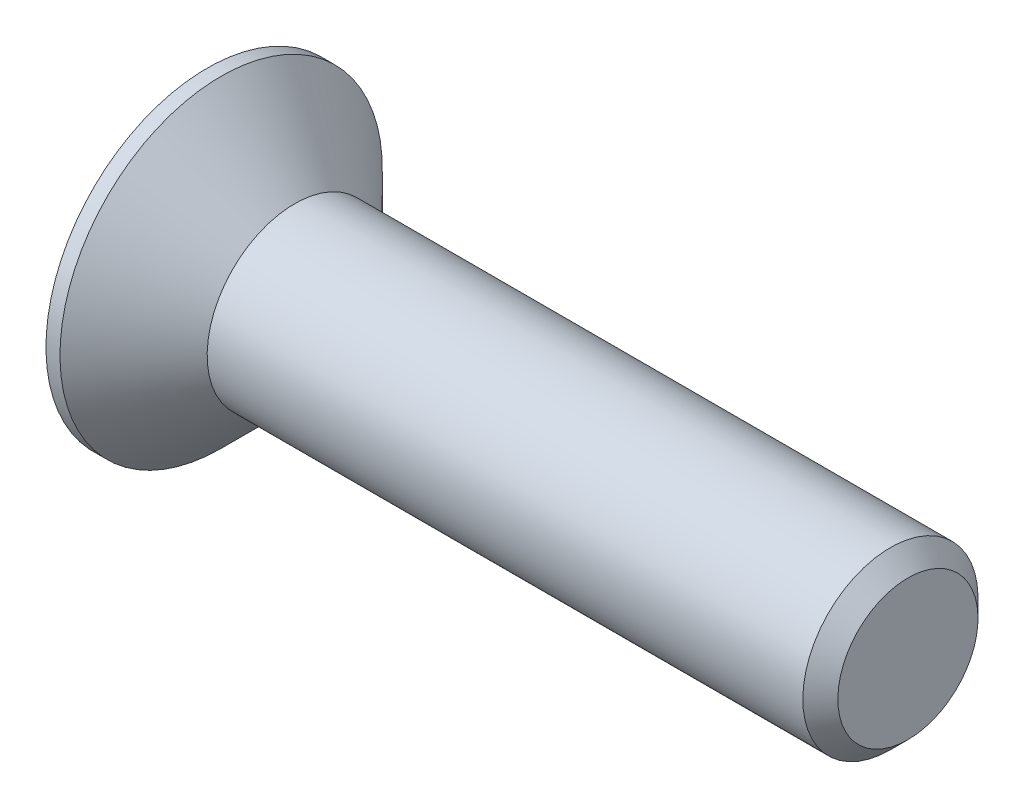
ISO-10303-21;
HEADER;
FILE_DESCRIPTION(('STEP AP214'),'2;1');
FILE_NAME('part.step','',(''),(''),'','','');
FILE_SCHEMA(('AUTOMOTIVE_DESIGN { 1 0 10303 214 1 1 1 1 }'));
ENDSEC;
DATA;
#1=APPLICATION_CONTEXT('core data for automotive mechanical design processes');
#2=APPLICATION_PROTOCOL_DEFINITION('international standard','automotive_design',2000,#1);
#3=PRODUCT_CONTEXT('',#1,'mechanical');
#4=PRODUCT('Part','Part','',(#3));
#5=PRODUCT_RELATED_PRODUCT_CATEGORY('part','',(#4));
#6=PRODUCT_DEFINITION_FORMATION('','',#4);
#7=PRODUCT_DEFINITION_CONTEXT('part definition',#1,'design');
#8=PRODUCT_DEFINITION('design','',#6,#7);
#9=PRODUCT_DEFINITION_SHAPE('','',#8);
#10=(LENGTH_UNIT() NAMED_UNIT(*) SI_UNIT(.MILLI.,.METRE.));
#11=(NAMED_UNIT(*) PLANE_ANGLE_UNIT() SI_UNIT($,.RADIAN.));
#12=(NAMED_UNIT(*) SI_UNIT($,.STERADIAN.) SOLID_ANGLE_UNIT());
#13=UNCERTAINTY_MEASURE_WITH_UNIT(LENGTH_MEASURE(1.E-05),#10,'distance_accuracy_value','');
#14=(GEOMETRIC_REPRESENTATION_CONTEXT(3) GLOBAL_UNCERTAINTY_ASSIGNED_CONTEXT((#13)) GLOBAL_UNIT_ASSIGNED_CONTEXT((#10,
#11,#12)) REPRESENTATION_CONTEXT('',''));
#15=CARTESIAN_POINT('',(0.,0.,0.));
#16=DIRECTION('',(0.,0.,1.));
#17=DIRECTION('',(1.,0.,0.));
#18=AXIS2_PLACEMENT_3D('',#15,#16,#17);
#19=CARTESIAN_POINT('',(0.,0.,0.));
#20=DIRECTION('',(-1.,0.,0.));
#21=DIRECTION('',(0.,-1.,0.));
#22=AXIS2_PLACEMENT_3D('',#19,#20,#21);
#23=CONICAL_SURFACE('',#22,2.5,0.78539816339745);
#24=CARTESIAN_POINT('',(-2.09999999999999,0.,0.));
#25=DIRECTION('',(-1.,0.,0.));
#26=DIRECTION('',(0.,-1.,0.));
#27=AXIS2_PLACEMENT_3D('',#24,#25,#26);
#28=CIRCLE('',#27,4.6);
#29=CARTESIAN_POINT('',(-2.09999999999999,-4.6,0.));
#30=VERTEX_POINT('',#29);
#31=EDGE_CURVE('E189',#30,#30,#28,.T.);
#32=ORIENTED_EDGE('',*,*,#31,.F.);
#33=EDGE_LOOP('',(#32));
#34=FACE_BOUND('',#33,.T.);
#35=CARTESIAN_POINT('',(0.,0.,0.));
#36=DIRECTION('',(-1.,0.,0.));
#37=DIRECTION('',(0.,-1.,0.));
#38=AXIS2_PLACEMENT_3D('',#35,#36,#37);
#39=CIRCLE('',#38,2.5);
#40=CARTESIAN_POINT('',(0.,-2.5,0.));
#41=VERTEX_POINT('',#40);
#42=EDGE_CURVE('E212',#41,#41,#39,.T.);
#43=ORIENTED_EDGE('',*,*,#42,.T.);
#44=EDGE_LOOP('',(#43));
#45=FACE_BOUND('',#44,.T.);
#46=ADVANCED_FACE('F33',(#34,#45),#23,.T.);
#47=CARTESIAN_POINT('',(-2.5,0.,0.));
#48=DIRECTION('',(-1.,0.,0.));
#49=DIRECTION('',(0.,-1.,0.));
#50=AXIS2_PLACEMENT_3D('',#47,#48,#49);
#51=CYLINDRICAL_SURFACE('',#50,2.5);
#52=CARTESIAN_POINT('',(17.,0.,0.));
#53=DIRECTION('',(-1.,0.,0.));
#54=DIRECTION('',(0.,-1.,0.));
#55=AXIS2_PLACEMENT_3D('',#52,#53,#54);
#56=CIRCLE('',#55,2.5);
#57=CARTESIAN_POINT('',(17.,-2.5,0.));
#58=VERTEX_POINT('',#57);
#59=EDGE_CURVE('E41',#58,#58,#56,.T.);
#60=ORIENTED_EDGE('',*,*,#59,.T.);
#61=EDGE_LOOP('',(#60));
#62=FACE_BOUND('',#61,.T.);
#63=ORIENTED_EDGE('',*,*,#42,.F.);
#64=EDGE_LOOP('',(#63));
#65=FACE_BOUND('',#64,.T.);
#66=ADVANCED_FACE('F217',(#62,#65),#51,.T.);
#67=CARTESIAN_POINT('',(17.5,0.,0.));
#68=DIRECTION('',(-1.,0.,0.));
#69=DIRECTION('',(0.,-1.,0.));
#70=AXIS2_PLACEMENT_3D('',#67,#68,#69);
#71=PLANE('',#70);
#72=CARTESIAN_POINT('',(17.5,0.,0.));
#73=DIRECTION('',(-1.,0.,0.));
#74=DIRECTION('',(0.,-1.,0.));
#75=AXIS2_PLACEMENT_3D('',#72,#73,#74);
#76=CIRCLE('',#75,1.99999999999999);
#77=CARTESIAN_POINT('',(17.5,-1.99999999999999,0.));
#78=VERTEX_POINT('',#77);
#79=EDGE_CURVE('E11',#78,#78,#76,.F.);
#80=ORIENTED_EDGE('',*,*,#79,.T.);
#81=EDGE_LOOP('',(#80));
#82=FACE_BOUND('',#81,.T.);
#83=ADVANCED_FACE('F239',(#82),#71,.F.);
#84=CARTESIAN_POINT('',(-2.5,4.6,0.));
#85=DIRECTION('',(1.,0.,0.));
#86=DIRECTION('',(0.,1.,0.));
#87=AXIS2_PLACEMENT_3D('',#84,#85,#86);
#88=PLANE('',#87);
#89=DIRECTION('',(0.,0.,-1.));
#90=VECTOR('',#89,1.);
#91=CARTESIAN_POINT('',(-2.5,0.575,-2.3));
#92=LINE('',#91,#90);
#93=CARTESIAN_POINT('',(-2.5,0.575,-0.575));
#94=VERTEX_POINT('',#93);
#95=CARTESIAN_POINT('',(-2.5,0.575,-2.3));
#96=VERTEX_POINT('',#95);
#97=EDGE_CURVE('E158',#94,#96,#92,.T.);
#98=ORIENTED_EDGE('',*,*,#97,.F.);
#99=DIRECTION('',(0.,-1.,0.));
#100=VECTOR('',#99,1.);
#101=CARTESIAN_POINT('',(-2.5,0.575,-0.575));
#102=LINE('',#101,#100);
#103=CARTESIAN_POINT('',(-2.5,2.3,-0.575));
#104=VERTEX_POINT('',#103);
#105=EDGE_CURVE('E48',#104,#94,#102,.T.);
#106=ORIENTED_EDGE('',*,*,#105,.F.);
#107=DIRECTION('',(0.,0.,-1.));
#108=VECTOR('',#107,1.);
#109=CARTESIAN_POINT('',(-2.5,2.3,-0.575));
#110=LINE('',#109,#108);
#111=CARTESIAN_POINT('',(-2.5,2.3,0.575));
#112=VERTEX_POINT('',#111);
#113=EDGE_CURVE('E185',#112,#104,#110,.T.);
#114=ORIENTED_EDGE('',*,*,#113,.F.);
#115=DIRECTION('',(0.,1.,0.));
#116=VECTOR('',#115,1.);
#117=CARTESIAN_POINT('',(-2.5,2.3,0.575));
#118=LINE('',#117,#116);
#119=CARTESIAN_POINT('',(-2.5,0.575,0.575));
#120=VERTEX_POINT('',#119);
#121=EDGE_CURVE('E183',#120,#112,#118,.T.);
#122=ORIENTED_EDGE('',*,*,#121,.F.);
#123=DIRECTION('',(0.,0.,-1.));
#124=VECTOR('',#123,1.);
#125=CARTESIAN_POINT('',(-2.5,0.575,0.575));
#126=LINE('',#125,#124);
#127=CARTESIAN_POINT('',(-2.5,0.575,2.3));
#128=VERTEX_POINT('',#127);
#129=EDGE_CURVE('E132',#128,#120,#126,.T.);
#130=ORIENTED_EDGE('',*,*,#129,.F.);
#131=DIRECTION('',(0.,1.,0.));
#132=VECTOR('',#131,1.);
#133=CARTESIAN_POINT('',(-2.5,0.575,2.3));
#134=LINE('',#133,#132);
#135=CARTESIAN_POINT('',(-2.5,-0.575,2.3));
#136=VERTEX_POINT('',#135);
#137=EDGE_CURVE('E179',#136,#128,#134,.T.);
#138=ORIENTED_EDGE('',*,*,#137,.F.);
#139=DIRECTION('',(0.,0.,1.));
#140=VECTOR('',#139,1.);
#141=CARTESIAN_POINT('',(-2.5,-0.575,2.3));
#142=LINE('',#141,#140);
#143=CARTESIAN_POINT('',(-2.5,-0.575,0.575));
#144=VERTEX_POINT('',#143);
#145=EDGE_CURVE('E176',#144,#136,#142,.T.);
#146=ORIENTED_EDGE('',*,*,#145,.F.);
#147=DIRECTION('',(0.,1.,0.));
#148=VECTOR('',#147,1.);
#149=CARTESIAN_POINT('',(-2.5,-0.575,0.575));
#150=LINE('',#149,#148);
#151=CARTESIAN_POINT('',(-2.5,-2.3,0.575));
#152=VERTEX_POINT('',#151);
#153=EDGE_CURVE('E173',#152,#144,#150,.T.);
#154=ORIENTED_EDGE('',*,*,#153,.F.);
#155=DIRECTION('',(0.,0.,1.));
#156=VECTOR('',#155,1.);
#157=CARTESIAN_POINT('',(-2.5,-2.3,0.575));
#158=LINE('',#157,#156);
#159=CARTESIAN_POINT('',(-2.5,-2.3,-0.575));
#160=VERTEX_POINT('',#159);
#161=EDGE_CURVE('E170',#160,#152,#158,.T.);
#162=ORIENTED_EDGE('',*,*,#161,.F.);
#163=DIRECTION('',(0.,-1.,0.));
#164=VECTOR('',#163,1.);
#165=CARTESIAN_POINT('',(-2.5,-2.3,-0.575));
#166=LINE('',#165,#164);
#167=CARTESIAN_POINT('',(-2.5,-0.575,-0.575));
#168=VERTEX_POINT('',#167);
#169=EDGE_CURVE('E167',#168,#160,#166,.T.);
#170=ORIENTED_EDGE('',*,*,#169,.F.);
#171=DIRECTION('',(0.,0.,1.));
#172=VECTOR('',#171,1.);
#173=CARTESIAN_POINT('',(-2.5,-0.575,-0.575));
#174=LINE('',#173,#172);
#175=CARTESIAN_POINT('',(-2.5,-0.575,-2.3));
#176=VERTEX_POINT('',#175);
#177=EDGE_CURVE('E164',#176,#168,#174,.T.);
#178=ORIENTED_EDGE('',*,*,#177,.F.);
#179=DIRECTION('',(0.,-1.,0.));
#180=VECTOR('',#179,1.);
#181=CARTESIAN_POINT('',(-2.5,-0.575,-2.3));
#182=LINE('',#181,#180);
#183=EDGE_CURVE('E161',#96,#176,#182,.T.);
#184=ORIENTED_EDGE('',*,*,#183,.F.);
#185=EDGE_LOOP('',(#98,#106,#114,#122,#130,#138,#146,#154,#162,#170,#178,#184));
#186=FACE_BOUND('',#185,.T.);
#187=CARTESIAN_POINT('',(-2.5,0.,0.));
#188=DIRECTION('',(-1.,0.,0.));
#189=DIRECTION('',(0.,-1.,0.));
#190=AXIS2_PLACEMENT_3D('',#187,#188,#189);
#191=CIRCLE('',#190,4.6);
#192=CARTESIAN_POINT('',(-2.5,-4.6,0.));
#193=VERTEX_POINT('',#192);
#194=EDGE_CURVE('E209',#193,#193,#191,.T.);
#195=ORIENTED_EDGE('',*,*,#194,.T.);
#196=EDGE_LOOP('',(#195));
#197=FACE_BOUND('',#196,.T.);
#198=ADVANCED_FACE('F230',(#186,#197),#88,.F.);
#199=CARTESIAN_POINT('',(-2.5,0.,0.));
#200=DIRECTION('',(-1.,0.,0.));
#201=DIRECTION('',(0.,-1.,0.));
#202=AXIS2_PLACEMENT_3D('',#199,#200,#201);
#203=CYLINDRICAL_SURFACE('',#202,4.6);
#204=ORIENTED_EDGE('',*,*,#194,.F.);
#205=EDGE_LOOP('',(#204));
#206=FACE_BOUND('',#205,.T.);
#207=ORIENTED_EDGE('',*,*,#31,.T.);
#208=EDGE_LOOP('',(#207));
#209=FACE_BOUND('',#208,.T.);
#210=ADVANCED_FACE('F222',(#206,#209),#203,.T.);
#211=CARTESIAN_POINT('',(17.,0.,0.));
#212=DIRECTION('',(-1.,0.,0.));
#213=DIRECTION('',(0.,-1.,0.));
#214=AXIS2_PLACEMENT_3D('',#211,#212,#213);
#215=CONICAL_SURFACE('',#214,2.5,0.785398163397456);
#216=ORIENTED_EDGE('',*,*,#79,.F.);
#217=EDGE_LOOP('',(#216));
#218=FACE_BOUND('',#217,.T.);
#219=ORIENTED_EDGE('',*,*,#59,.F.);
#220=EDGE_LOOP('',(#219));
#221=FACE_BOUND('',#220,.T.);
#222=ADVANCED_FACE('F35',(#218,#221),#215,.T.);
#223=CARTESIAN_POINT('',(-0.4,0.575,-0.575));
#224=DIRECTION('',(0.,0.,-1.));
#225=DIRECTION('',(-1.,0.,0.));
#226=AXIS2_PLACEMENT_3D('',#223,#224,#225);
#227=PLANE('',#226);
#228=ORIENTED_EDGE('',*,*,#105,.T.);
#229=DIRECTION('',(-1.,0.,0.));
#230=VECTOR('',#229,1.);
#231=CARTESIAN_POINT('',(-0.4,0.575,-0.575));
#232=LINE('',#231,#230);
#233=CARTESIAN_POINT('',(-0.4,0.575,-0.575));
#234=VERTEX_POINT('',#233);
#235=EDGE_CURVE('E96',#234,#94,#232,.T.);
#236=ORIENTED_EDGE('',*,*,#235,.F.);
#237=DIRECTION('',(0.,-1.,0.));
#238=VECTOR('',#237,1.);
#239=CARTESIAN_POINT('',(-0.4,0.575,-0.575));
#240=LINE('',#239,#238);
#241=CARTESIAN_POINT('',(-0.4,2.3,-0.575));
#242=VERTEX_POINT('',#241);
#243=EDGE_CURVE('E187',#242,#234,#240,.T.);
#244=ORIENTED_EDGE('',*,*,#243,.F.);
#245=DIRECTION('',(-1.,0.,0.));
#246=VECTOR('',#245,1.);
#247=CARTESIAN_POINT('',(-0.4,2.3,-0.575));
#248=LINE('',#247,#246);
#249=EDGE_CURVE('E56',#242,#104,#248,.T.);
#250=ORIENTED_EDGE('',*,*,#249,.T.);
#251=EDGE_LOOP('',(#228,#236,#244,#250));
#252=FACE_BOUND('',#251,.T.);
#253=ADVANCED_FACE('F221',(#252),#227,.F.);
#254=CARTESIAN_POINT('',(-0.4,2.3,-0.575));
#255=DIRECTION('',(0.,1.,0.));
#256=DIRECTION('',(-1.,0.,0.));
#257=AXIS2_PLACEMENT_3D('',#254,#255,#256);
#258=PLANE('',#257);
#259=ORIENTED_EDGE('',*,*,#113,.T.);
#260=ORIENTED_EDGE('',*,*,#249,.F.);
#261=DIRECTION('',(0.,0.,-1.));
#262=VECTOR('',#261,1.);
#263=CARTESIAN_POINT('',(-0.4,2.3,-0.575));
#264=LINE('',#263,#262);
#265=CARTESIAN_POINT('',(-0.4,2.3,0.575));
#266=VERTEX_POINT('',#265);
#267=EDGE_CURVE('E144',#266,#242,#264,.T.);
#268=ORIENTED_EDGE('',*,*,#267,.F.);
#269=DIRECTION('',(-1.,0.,0.));
#270=VECTOR('',#269,1.);
#271=CARTESIAN_POINT('',(-0.4,2.3,0.575));
#272=LINE('',#271,#270);
#273=EDGE_CURVE('E136',#266,#112,#272,.T.);
#274=ORIENTED_EDGE('',*,*,#273,.T.);
#275=EDGE_LOOP('',(#259,#260,#268,#274));
#276=FACE_BOUND('',#275,.T.);
#277=ADVANCED_FACE('F228',(#276),#258,.F.);
#278=CARTESIAN_POINT('',(-0.4,2.3,0.575));
#279=DIRECTION('',(0.,0.,1.));
#280=DIRECTION('',(1.,0.,0.));
#281=AXIS2_PLACEMENT_3D('',#278,#279,#280);
#282=PLANE('',#281);
#283=ORIENTED_EDGE('',*,*,#121,.T.);
#284=ORIENTED_EDGE('',*,*,#273,.F.);
#285=DIRECTION('',(0.,1.,0.));
#286=VECTOR('',#285,1.);
#287=CARTESIAN_POINT('',(-0.4,2.3,0.575));
#288=LINE('',#287,#286);
#289=CARTESIAN_POINT('',(-0.4,0.575,0.575));
#290=VERTEX_POINT('',#289);
#291=EDGE_CURVE('E140',#290,#266,#288,.T.);
#292=ORIENTED_EDGE('',*,*,#291,.F.);
#293=DIRECTION('',(-1.,0.,0.));
#294=VECTOR('',#293,1.);
#295=CARTESIAN_POINT('',(-0.4,0.575,0.575));
#296=LINE('',#295,#294);
#297=EDGE_CURVE('E125',#290,#120,#296,.T.);
#298=ORIENTED_EDGE('',*,*,#297,.T.);
#299=EDGE_LOOP('',(#283,#284,#292,#298));
#300=FACE_BOUND('',#299,.T.);
#301=ADVANCED_FACE('F141',(#300),#282,.F.);
#302=CARTESIAN_POINT('',(-0.4,0.575,0.575));
#303=DIRECTION('',(0.,1.,0.));
#304=DIRECTION('',(-1.,0.,0.));
#305=AXIS2_PLACEMENT_3D('',#302,#303,#304);
#306=PLANE('',#305);
#307=ORIENTED_EDGE('',*,*,#129,.T.);
#308=ORIENTED_EDGE('',*,*,#297,.F.);
#309=DIRECTION('',(0.,0.,-1.));
#310=VECTOR('',#309,1.);
#311=CARTESIAN_POINT('',(-0.4,0.575,0.575));
#312=LINE('',#311,#310);
#313=CARTESIAN_POINT('',(-0.4,0.575,2.3));
#314=VERTEX_POINT('',#313);
#315=EDGE_CURVE('E129',#314,#290,#312,.T.);
#316=ORIENTED_EDGE('',*,*,#315,.F.);
#317=DIRECTION('',(-1.,0.,0.));
#318=VECTOR('',#317,1.);
#319=CARTESIAN_POINT('',(-0.4,0.575,2.3));
#320=LINE('',#319,#318);
#321=EDGE_CURVE('E137',#314,#128,#320,.T.);
#322=ORIENTED_EDGE('',*,*,#321,.T.);
#323=EDGE_LOOP('',(#307,#308,#316,#322));
#324=FACE_BOUND('',#323,.T.);
#325=ADVANCED_FACE('F127',(#324),#306,.F.);
#326=CARTESIAN_POINT('',(-0.4,0.575,2.3));
#327=DIRECTION('',(0.,0.,1.));
#328=DIRECTION('',(1.,0.,0.));
#329=AXIS2_PLACEMENT_3D('',#326,#327,#328);
#330=PLANE('',#329);
#331=ORIENTED_EDGE('',*,*,#137,.T.);
#332=ORIENTED_EDGE('',*,*,#321,.F.);
#333=DIRECTION('',(0.,1.,0.));
#334=VECTOR('',#333,1.);
#335=CARTESIAN_POINT('',(-0.4,0.575,2.3));
#336=LINE('',#335,#334);
#337=CARTESIAN_POINT('',(-0.4,-0.575,2.3));
#338=VERTEX_POINT('',#337);
#339=EDGE_CURVE('E150',#338,#314,#336,.T.);
#340=ORIENTED_EDGE('',*,*,#339,.F.);
#341=DIRECTION('',(-1.,0.,0.));
#342=VECTOR('',#341,1.);
#343=CARTESIAN_POINT('',(-0.4,-0.575,2.3));
#344=LINE('',#343,#342);
#345=EDGE_CURVE('E192',#338,#136,#344,.T.);
#346=ORIENTED_EDGE('',*,*,#345,.T.);
#347=EDGE_LOOP('',(#331,#332,#340,#346));
#348=FACE_BOUND('',#347,.T.);
#349=ADVANCED_FACE('F277',(#348),#330,.F.);
#350=CARTESIAN_POINT('',(-0.4,-0.575,2.3));
#351=DIRECTION('',(0.,-1.,0.));
#352=DIRECTION('',(1.,0.,0.));
#353=AXIS2_PLACEMENT_3D('',#350,#351,#352);
#354=PLANE('',#353);
#355=ORIENTED_EDGE('',*,*,#145,.T.);
#356=ORIENTED_EDGE('',*,*,#345,.F.);
#357=DIRECTION('',(0.,0.,1.));
#358=VECTOR('',#357,1.);
#359=CARTESIAN_POINT('',(-0.4,-0.575,2.3));
#360=LINE('',#359,#358);
#361=CARTESIAN_POINT('',(-0.4,-0.575,0.575));
#362=VERTEX_POINT('',#361);
#363=EDGE_CURVE('E152',#362,#338,#360,.T.);
#364=ORIENTED_EDGE('',*,*,#363,.F.);
#365=DIRECTION('',(-1.,0.,0.));
#366=VECTOR('',#365,1.);
#367=CARTESIAN_POINT('',(-0.4,-0.575,0.575));
#368=LINE('',#367,#366);
#369=EDGE_CURVE('E194',#362,#144,#368,.T.);
#370=ORIENTED_EDGE('',*,*,#369,.T.);
#371=EDGE_LOOP('',(#355,#356,#364,#370));
#372=FACE_BOUND('',#371,.T.);
#373=ADVANCED_FACE('F273',(#372),#354,.F.);
#374=CARTESIAN_POINT('',(-0.4,-0.575,0.575));
#375=DIRECTION('',(0.,0.,1.));
#376=DIRECTION('',(1.,0.,0.));
#377=AXIS2_PLACEMENT_3D('',#374,#375,#376);
#378=PLANE('',#377);
#379=ORIENTED_EDGE('',*,*,#153,.T.);
#380=ORIENTED_EDGE('',*,*,#369,.F.);
#381=DIRECTION('',(0.,1.,0.));
#382=VECTOR('',#381,1.);
#383=CARTESIAN_POINT('',(-0.4,-0.575,0.575));
#384=LINE('',#383,#382);
#385=CARTESIAN_POINT('',(-0.4,-2.3,0.575));
#386=VERTEX_POINT('',#385);
#387=EDGE_CURVE('E422',#386,#362,#384,.T.);
#388=ORIENTED_EDGE('',*,*,#387,.F.);
#389=DIRECTION('',(-1.,0.,0.));
#390=VECTOR('',#389,1.);
#391=CARTESIAN_POINT('',(-0.4,-2.3,0.575));
#392=LINE('',#391,#390);
#393=EDGE_CURVE('E196',#386,#152,#392,.T.);
#394=ORIENTED_EDGE('',*,*,#393,.T.);
#395=EDGE_LOOP('',(#379,#380,#388,#394));
#396=FACE_BOUND('',#395,.T.);
#397=ADVANCED_FACE('F269',(#396),#378,.F.);
#398=CARTESIAN_POINT('',(-0.4,-2.3,0.575));
#399=DIRECTION('',(0.,-1.,0.));
#400=DIRECTION('',(1.,0.,0.));
#401=AXIS2_PLACEMENT_3D('',#398,#399,#400);
#402=PLANE('',#401);
#403=ORIENTED_EDGE('',*,*,#161,.T.);
#404=ORIENTED_EDGE('',*,*,#393,.F.);
#405=DIRECTION('',(0.,0.,1.));
#406=VECTOR('',#405,1.);
#407=CARTESIAN_POINT('',(-0.4,-2.3,0.575));
#408=LINE('',#407,#406);
#409=CARTESIAN_POINT('',(-0.4,-2.3,-0.575));
#410=VERTEX_POINT('',#409);
#411=EDGE_CURVE('E419',#410,#386,#408,.T.);
#412=ORIENTED_EDGE('',*,*,#411,.F.);
#413=DIRECTION('',(-1.,0.,0.));
#414=VECTOR('',#413,1.);
#415=CARTESIAN_POINT('',(-0.4,-2.3,-0.575));
#416=LINE('',#415,#414);
#417=EDGE_CURVE('E198',#410,#160,#416,.T.);
#418=ORIENTED_EDGE('',*,*,#417,.T.);
#419=EDGE_LOOP('',(#403,#404,#412,#418));
#420=FACE_BOUND('',#419,.T.);
#421=ADVANCED_FACE('F265',(#420),#402,.F.);
#422=CARTESIAN_POINT('',(-0.4,-2.3,-0.575));
#423=DIRECTION('',(0.,0.,-1.));
#424=DIRECTION('',(-1.,0.,0.));
#425=AXIS2_PLACEMENT_3D('',#422,#423,#424);
#426=PLANE('',#425);
#427=ORIENTED_EDGE('',*,*,#169,.T.);
#428=ORIENTED_EDGE('',*,*,#417,.F.);
#429=DIRECTION('',(0.,-1.,0.));
#430=VECTOR('',#429,1.);
#431=CARTESIAN_POINT('',(-0.4,-2.3,-0.575));
#432=LINE('',#431,#430);
#433=CARTESIAN_POINT('',(-0.4,-0.575,-0.575));
#434=VERTEX_POINT('',#433);
#435=EDGE_CURVE('E416',#434,#410,#432,.T.);
#436=ORIENTED_EDGE('',*,*,#435,.F.);
#437=DIRECTION('',(-1.,0.,0.));
#438=VECTOR('',#437,1.);
#439=CARTESIAN_POINT('',(-0.4,-0.575,-0.575));
#440=LINE('',#439,#438);
#441=EDGE_CURVE('E200',#434,#168,#440,.T.);
#442=ORIENTED_EDGE('',*,*,#441,.T.);
#443=EDGE_LOOP('',(#427,#428,#436,#442));
#444=FACE_BOUND('',#443,.T.);
#445=ADVANCED_FACE('F261',(#444),#426,.F.);
#446=CARTESIAN_POINT('',(-0.4,-0.575,-0.575));
#447=DIRECTION('',(0.,-1.,0.));
#448=DIRECTION('',(1.,0.,0.));
#449=AXIS2_PLACEMENT_3D('',#446,#447,#448);
#450=PLANE('',#449);
#451=ORIENTED_EDGE('',*,*,#177,.T.);
#452=ORIENTED_EDGE('',*,*,#441,.F.);
#453=DIRECTION('',(0.,0.,1.));
#454=VECTOR('',#453,1.);
#455=CARTESIAN_POINT('',(-0.4,-0.575,-0.575));
#456=LINE('',#455,#454);
#457=CARTESIAN_POINT('',(-0.4,-0.575,-2.3));
#458=VERTEX_POINT('',#457);
#459=EDGE_CURVE('E413',#458,#434,#456,.T.);
#460=ORIENTED_EDGE('',*,*,#459,.F.);
#461=DIRECTION('',(-1.,0.,0.));
#462=VECTOR('',#461,1.);
#463=CARTESIAN_POINT('',(-0.4,-0.575,-2.3));
#464=LINE('',#463,#462);
#465=EDGE_CURVE('E202',#458,#176,#464,.T.);
#466=ORIENTED_EDGE('',*,*,#465,.T.);
#467=EDGE_LOOP('',(#451,#452,#460,#466));
#468=FACE_BOUND('',#467,.T.);
#469=ADVANCED_FACE('F257',(#468),#450,.F.);
#470=CARTESIAN_POINT('',(-0.4,-0.575,-2.3));
#471=DIRECTION('',(0.,0.,-1.));
#472=DIRECTION('',(-1.,0.,0.));
#473=AXIS2_PLACEMENT_3D('',#470,#471,#472);
#474=PLANE('',#473);
#475=ORIENTED_EDGE('',*,*,#183,.T.);
#476=ORIENTED_EDGE('',*,*,#465,.F.);
#477=DIRECTION('',(0.,-1.,0.));
#478=VECTOR('',#477,1.);
#479=CARTESIAN_POINT('',(-0.4,-0.575,-2.3));
#480=LINE('',#479,#478);
#481=CARTESIAN_POINT('',(-0.4,0.575,-2.3));
#482=VERTEX_POINT('',#481);
#483=EDGE_CURVE('E408',#482,#458,#480,.T.);
#484=ORIENTED_EDGE('',*,*,#483,.F.);
#485=DIRECTION('',(-1.,0.,0.));
#486=VECTOR('',#485,1.);
#487=CARTESIAN_POINT('',(-0.4,0.575,-2.3));
#488=LINE('',#487,#486);
#489=EDGE_CURVE('E204',#482,#96,#488,.T.);
#490=ORIENTED_EDGE('',*,*,#489,.T.);
#491=EDGE_LOOP('',(#475,#476,#484,#490));
#492=FACE_BOUND('',#491,.T.);
#493=ADVANCED_FACE('F253',(#492),#474,.F.);
#494=CARTESIAN_POINT('',(-0.4,0.575,-2.3));
#495=DIRECTION('',(0.,1.,0.));
#496=DIRECTION('',(-1.,0.,0.));
#497=AXIS2_PLACEMENT_3D('',#494,#495,#496);
#498=PLANE('',#497);
#499=ORIENTED_EDGE('',*,*,#97,.T.);
#500=ORIENTED_EDGE('',*,*,#489,.F.);
#501=DIRECTION('',(0.,0.,-1.));
#502=VECTOR('',#501,1.);
#503=CARTESIAN_POINT('',(-0.4,0.575,-2.3));
#504=LINE('',#503,#502);
#505=EDGE_CURVE('E406',#234,#482,#504,.T.);
#506=ORIENTED_EDGE('',*,*,#505,.F.);
#507=ORIENTED_EDGE('',*,*,#235,.T.);
#508=EDGE_LOOP('',(#499,#500,#506,#507));
#509=FACE_BOUND('',#508,.T.);
#510=ADVANCED_FACE('F250',(#509),#498,.F.);
#511=CARTESIAN_POINT('',(-0.4,0.,0.));
#512=DIRECTION('',(1.,0.,0.));
#513=DIRECTION('',(0.,0.,-1.));
#514=AXIS2_PLACEMENT_3D('',#511,#512,#513);
#515=PLANE('',#514);
#516=ORIENTED_EDGE('',*,*,#243,.T.);
#517=ORIENTED_EDGE('',*,*,#505,.T.);
#518=ORIENTED_EDGE('',*,*,#483,.T.);
#519=ORIENTED_EDGE('',*,*,#459,.T.);
#520=ORIENTED_EDGE('',*,*,#435,.T.);
#521=ORIENTED_EDGE('',*,*,#411,.T.);
#522=ORIENTED_EDGE('',*,*,#387,.T.);
#523=ORIENTED_EDGE('',*,*,#363,.T.);
#524=ORIENTED_EDGE('',*,*,#339,.T.);
#525=ORIENTED_EDGE('',*,*,#315,.T.);
#526=ORIENTED_EDGE('',*,*,#291,.T.);
#527=ORIENTED_EDGE('',*,*,#267,.T.);
#528=EDGE_LOOP('',(#516,#517,#518,#519,#520,#521,#522,#523,#524,#525,#526,#527));
#529=FACE_BOUND('',#528,.T.);
#530=ADVANCED_FACE('F147',(#529),#515,.F.);
#531=CLOSED_SHELL('',(#46,#66,#83,#198,#210,#222,#253,#277,#301,#325,#349,#373,#397,#421,#445,
#469,#493,#510,#530));
#532=MANIFOLD_SOLID_BREP('B2',#531);
#533=ADVANCED_BREP_SHAPE_REPRESENTATION('',(#18,#532),#14);
#534=SHAPE_DEFINITION_REPRESENTATION(#9,#533);
ENDSEC;
END-ISO-10303-21;
